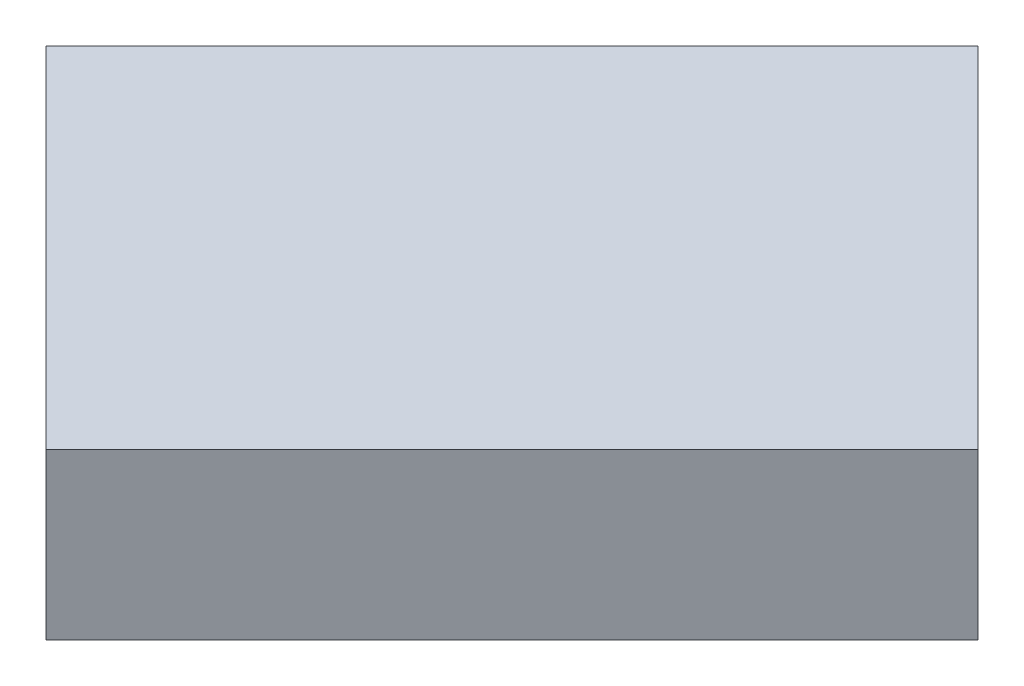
ISO-10303-21;
HEADER;
FILE_DESCRIPTION(('STEP AP214'),'2;1');
FILE_NAME('part.step','',(''),(''),'','','');
FILE_SCHEMA(('AUTOMOTIVE_DESIGN { 1 0 10303 214 1 1 1 1 }'));
ENDSEC;
DATA;
#1=APPLICATION_CONTEXT('core data for automotive mechanical design processes');
#2=APPLICATION_PROTOCOL_DEFINITION('international standard','automotive_design',2000,#1);
#3=PRODUCT_CONTEXT('',#1,'mechanical');
#4=PRODUCT('Part','Part','',(#3));
#5=PRODUCT_RELATED_PRODUCT_CATEGORY('part','',(#4));
#6=PRODUCT_DEFINITION_FORMATION('','',#4);
#7=PRODUCT_DEFINITION_CONTEXT('part definition',#1,'design');
#8=PRODUCT_DEFINITION('design','',#6,#7);
#9=PRODUCT_DEFINITION_SHAPE('','',#8);
#10=(LENGTH_UNIT() NAMED_UNIT(*) SI_UNIT(.MILLI.,.METRE.));
#11=(NAMED_UNIT(*) PLANE_ANGLE_UNIT() SI_UNIT($,.RADIAN.));
#12=(NAMED_UNIT(*) SI_UNIT($,.STERADIAN.) SOLID_ANGLE_UNIT());
#13=UNCERTAINTY_MEASURE_WITH_UNIT(LENGTH_MEASURE(1.E-05),#10,'distance_accuracy_value','');
#14=(GEOMETRIC_REPRESENTATION_CONTEXT(3) GLOBAL_UNCERTAINTY_ASSIGNED_CONTEXT((#13)) GLOBAL_UNIT_ASSIGNED_CONTEXT((#10,
#11,#12)) REPRESENTATION_CONTEXT('',''));
#15=CARTESIAN_POINT('',(0.,0.,0.));
#16=DIRECTION('',(0.,0.,1.));
#17=DIRECTION('',(1.,0.,0.));
#18=AXIS2_PLACEMENT_3D('',#15,#16,#17);
#19=CARTESIAN_POINT('',(85.9955660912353,-78.179187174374,-124.097240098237));
#20=DIRECTION('',(0.,1.,0.));
#21=DIRECTION('',(-1.,0.,0.));
#22=AXIS2_PLACEMENT_3D('',#19,#20,#21);
#23=PLANE('',#22);
#24=DIRECTION('',(-0.707106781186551,0.,0.707106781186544));
#25=VECTOR('',#24,1.);
#26=CARTESIAN_POINT('',(88.8239932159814,-78.179187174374,-126.925667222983));
#27=LINE('',#26,#25);
#28=CARTESIAN_POINT('',(85.995566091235,-78.179187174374,-124.097240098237));
#29=VERTEX_POINT('',#28);
#30=CARTESIAN_POINT('',(88.8239932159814,-78.179187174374,-126.925667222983));
#31=VERTEX_POINT('',#30);
#32=EDGE_CURVE('E20',#29,#31,#27,.F.);
#33=ORIENTED_EDGE('',*,*,#32,.F.);
#34=DIRECTION('',(0.707106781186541,0.,0.707106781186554));
#35=VECTOR('',#34,1.);
#36=CARTESIAN_POINT('',(85.9955660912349,-78.179187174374,-124.097240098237));
#37=LINE('',#36,#35);
#38=CARTESIAN_POINT('',(88.1168864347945,-78.179187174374,-121.975919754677));
#39=VERTEX_POINT('',#38);
#40=EDGE_CURVE('E58',#39,#29,#37,.F.);
#41=ORIENTED_EDGE('',*,*,#40,.F.);
#42=DIRECTION('',(0.707106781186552,0.,-0.707106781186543));
#43=VECTOR('',#42,1.);
#44=CARTESIAN_POINT('',(88.1168864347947,-78.1791871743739,-121.975919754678));
#45=LINE('',#44,#43);
#46=CARTESIAN_POINT('',(90.9453135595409,-78.179187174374,-124.804346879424));
#47=VERTEX_POINT('',#46);
#48=EDGE_CURVE('E53',#47,#39,#45,.F.);
#49=ORIENTED_EDGE('',*,*,#48,.F.);
#50=DIRECTION('',(-0.707106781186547,0.,-0.707106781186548));
#51=VECTOR('',#50,1.);
#52=CARTESIAN_POINT('',(90.9453135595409,-78.179187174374,-124.804346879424));
#53=LINE('',#52,#51);
#54=EDGE_CURVE('E68',#31,#47,#53,.F.);
#55=ORIENTED_EDGE('',*,*,#54,.F.);
#56=EDGE_LOOP('',(#33,#41,#49,#55));
#57=FACE_BOUND('',#56,.T.);
#58=ADVANCED_FACE('F17',(#57),#23,.T.);
#59=CARTESIAN_POINT('',(88.8239932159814,-79.179187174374,-126.925667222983));
#60=DIRECTION('',(-0.707106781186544,0.,-0.707106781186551));
#61=DIRECTION('',(-0.707106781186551,0.,0.707106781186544));
#62=AXIS2_PLACEMENT_3D('',#59,#60,#61);
#63=PLANE('',#62);
#64=ORIENTED_EDGE('',*,*,#32,.T.);
#65=DIRECTION('',(0.,1.,0.));
#66=VECTOR('',#65,1.);
#67=CARTESIAN_POINT('',(88.8239932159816,-79.1791871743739,-126.925667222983));
#68=LINE('',#67,#66);
#69=CARTESIAN_POINT('',(88.8239932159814,-79.179187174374,-126.925667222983));
#70=VERTEX_POINT('',#69);
#71=EDGE_CURVE('E79',#70,#31,#68,.T.);
#72=ORIENTED_EDGE('',*,*,#71,.F.);
#73=DIRECTION('',(-0.707106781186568,0.,0.707106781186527));
#74=VECTOR('',#73,1.);
#75=CARTESIAN_POINT('',(88.8239932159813,-79.179187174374,-126.925667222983));
#76=LINE('',#75,#74);
#77=CARTESIAN_POINT('',(85.9955660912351,-79.179187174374,-124.097240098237));
#78=VERTEX_POINT('',#77);
#79=EDGE_CURVE('E74',#70,#78,#76,.T.);
#80=ORIENTED_EDGE('',*,*,#79,.T.);
#81=DIRECTION('',(0.,1.,0.));
#82=VECTOR('',#81,1.);
#83=CARTESIAN_POINT('',(85.995566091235,-79.179187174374,-124.097240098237));
#84=LINE('',#83,#82);
#85=EDGE_CURVE('E63',#29,#78,#84,.F.);
#86=ORIENTED_EDGE('',*,*,#85,.F.);
#87=EDGE_LOOP('',(#64,#72,#80,#86));
#88=FACE_BOUND('',#87,.T.);
#89=ADVANCED_FACE('F73',(#88),#63,.T.);
#90=CARTESIAN_POINT('',(85.9955660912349,-79.179187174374,-124.097240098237));
#91=DIRECTION('',(-0.707106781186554,0.,0.707106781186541));
#92=DIRECTION('',(0.707106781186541,0.,0.707106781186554));
#93=AXIS2_PLACEMENT_3D('',#90,#91,#92);
#94=PLANE('',#93);
#95=ORIENTED_EDGE('',*,*,#40,.T.);
#96=ORIENTED_EDGE('',*,*,#85,.T.);
#97=DIRECTION('',(0.707106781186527,0.,0.707106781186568));
#98=VECTOR('',#97,1.);
#99=CARTESIAN_POINT('',(85.995566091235,-79.179187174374,-124.097240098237));
#100=LINE('',#99,#98);
#101=CARTESIAN_POINT('',(88.1168864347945,-79.179187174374,-121.975919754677));
#102=VERTEX_POINT('',#101);
#103=EDGE_CURVE('E84',#78,#102,#100,.T.);
#104=ORIENTED_EDGE('',*,*,#103,.T.);
#105=DIRECTION('',(0.,1.,0.));
#106=VECTOR('',#105,1.);
#107=CARTESIAN_POINT('',(88.1168864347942,-79.179187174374,-121.975919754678));
#108=LINE('',#107,#106);
#109=EDGE_CURVE('E65',#39,#102,#108,.F.);
#110=ORIENTED_EDGE('',*,*,#109,.F.);
#111=EDGE_LOOP('',(#95,#96,#104,#110));
#112=FACE_BOUND('',#111,.T.);
#113=ADVANCED_FACE('F60',(#112),#94,.T.);
#114=CARTESIAN_POINT('',(88.1168864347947,-79.179187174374,-121.975919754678));
#115=DIRECTION('',(0.707106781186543,0.,0.707106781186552));
#116=DIRECTION('',(0.707106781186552,0.,-0.707106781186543));
#117=AXIS2_PLACEMENT_3D('',#114,#115,#116);
#118=PLANE('',#117);
#119=ORIENTED_EDGE('',*,*,#48,.T.);
#120=ORIENTED_EDGE('',*,*,#109,.T.);
#121=DIRECTION('',(0.707106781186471,0.,-0.707106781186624));
#122=VECTOR('',#121,1.);
#123=CARTESIAN_POINT('',(88.1168864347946,-79.179187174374,-121.975919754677));
#124=LINE('',#123,#122);
#125=CARTESIAN_POINT('',(90.9453135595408,-79.179187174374,-124.804346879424));
#126=VERTEX_POINT('',#125);
#127=EDGE_CURVE('E26',#102,#126,#124,.T.);
#128=ORIENTED_EDGE('',*,*,#127,.T.);
#129=DIRECTION('',(0.,1.,0.));
#130=VECTOR('',#129,1.);
#131=CARTESIAN_POINT('',(90.9453135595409,-79.1791871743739,-124.804346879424));
#132=LINE('',#131,#130);
#133=EDGE_CURVE('E34',#47,#126,#132,.F.);
#134=ORIENTED_EDGE('',*,*,#133,.F.);
#135=EDGE_LOOP('',(#119,#120,#128,#134));
#136=FACE_BOUND('',#135,.T.);
#137=ADVANCED_FACE('F88',(#136),#118,.T.);
#138=CARTESIAN_POINT('',(90.9453135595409,-79.1791871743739,-124.804346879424));
#139=DIRECTION('',(0.707106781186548,0.,-0.707106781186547));
#140=DIRECTION('',(-0.707106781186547,0.,-0.707106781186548));
#141=AXIS2_PLACEMENT_3D('',#138,#139,#140);
#142=PLANE('',#141);
#143=ORIENTED_EDGE('',*,*,#54,.T.);
#144=ORIENTED_EDGE('',*,*,#133,.T.);
#145=DIRECTION('',(-0.707106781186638,0.,-0.707106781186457));
#146=VECTOR('',#145,1.);
#147=CARTESIAN_POINT('',(90.9453135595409,-79.179187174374,-124.804346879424));
#148=LINE('',#147,#146);
#149=EDGE_CURVE('E11',#126,#70,#148,.T.);
#150=ORIENTED_EDGE('',*,*,#149,.T.);
#151=ORIENTED_EDGE('',*,*,#71,.T.);
#152=EDGE_LOOP('',(#143,#144,#150,#151));
#153=FACE_BOUND('',#152,.T.);
#154=ADVANCED_FACE('F91',(#153),#142,.T.);
#155=CARTESIAN_POINT('',(85.9955660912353,-79.179187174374,-124.097240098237));
#156=DIRECTION('',(0.,1.,0.));
#157=DIRECTION('',(-1.,0.,0.));
#158=AXIS2_PLACEMENT_3D('',#155,#156,#157);
#159=PLANE('',#158);
#160=ORIENTED_EDGE('',*,*,#127,.F.);
#161=ORIENTED_EDGE('',*,*,#103,.F.);
#162=ORIENTED_EDGE('',*,*,#79,.F.);
#163=ORIENTED_EDGE('',*,*,#149,.F.);
#164=EDGE_LOOP('',(#160,#161,#162,#163));
#165=FACE_BOUND('',#164,.T.);
#166=ADVANCED_FACE('F90',(#165),#159,.F.);
#167=CLOSED_SHELL('',(#58,#89,#113,#137,#154,#166));
#168=MANIFOLD_SOLID_BREP('B1',#167);
#169=ADVANCED_BREP_SHAPE_REPRESENTATION('',(#18,#168),#14);
#170=SHAPE_DEFINITION_REPRESENTATION(#9,#169);
ENDSEC;
END-ISO-10303-21;
